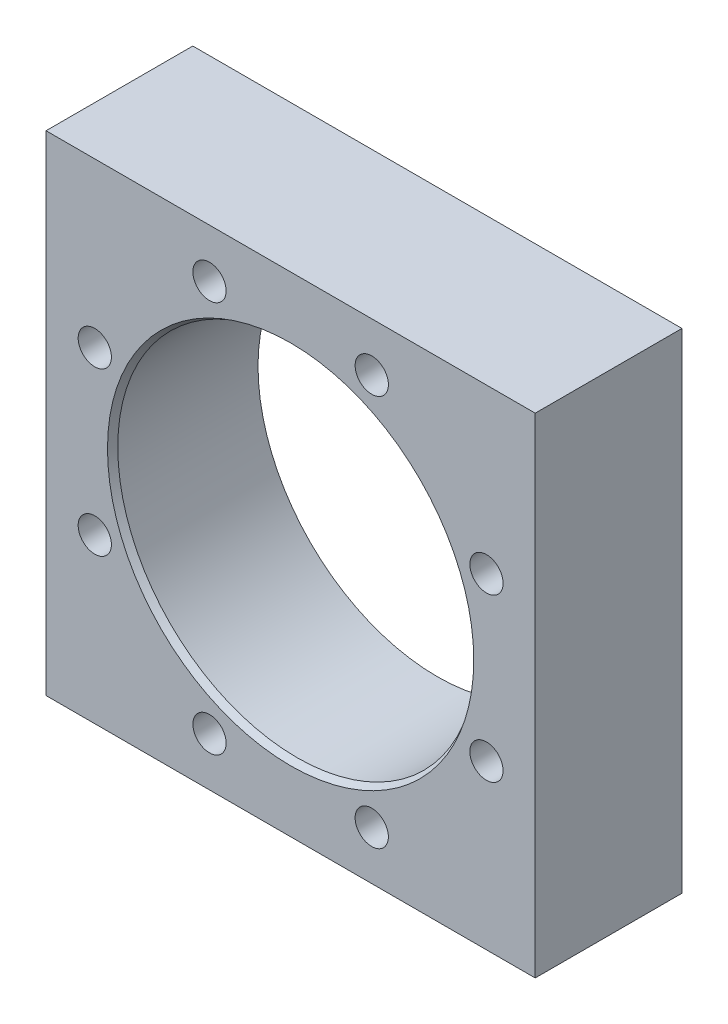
from build123d import *

# Parameters (mm, degrees)
ESQUISSE1_W                  = 150
ESQUISSE1_H                  = 150
ESQUISSE1_R                  = 55
EXTRUSION1_DEPTH             = 45
R_P_TITION_CIRCULAIRE1_COUNT = 8
CHANFREIN1_SIZE              = 2
CHANFREIN1_SIZE2             = 1.154700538


with BuildPart() as part:
    # Esquisse1 → Extrusion1 (new body)
    with BuildSketch(Plane.XY):
        with Locations((75, 75)):
            Rectangle(ESQUISSE1_W, ESQUISSE1_H)
        with Locations(Location((75, 75, 0), (0, 0, 180))):
            Circle(ESQUISSE1_R, mode=Mode.SUBTRACT)
    extrude(amount=EXTRUSION1_DEPTH)

    # Esquisse2 → Trou taraud_ M12x1.751 (revolve, cut)
    with BuildSketch(Plane(origin=(99.874423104, 135.052169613, 45), x_dir=(0, -1, 0), z_dir=(1, 0, 0))):
        Polygon((0, 0), (0, 38.064389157), (5.1, 35), (5.1, 0), align=None)
    trou_taraud_m12x1_751 = revolve(axis=Axis((99.874423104, 135.052169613, 51.35), (0, 0, -1)), mode=Mode.SUBTRACT)

    # R_p_tition circulaire1: Trou taraud_ M12x1.751 ×8 about axis
    r_p_tition_circulaire1_axis = Axis((75, 75, 0), (0, 0, 1))
    for i in range(1, R_P_TITION_CIRCULAIRE1_COUNT):
        add(trou_taraud_m12x1_751.rotate(r_p_tition_circulaire1_axis, i * 360 / R_P_TITION_CIRCULAIRE1_COUNT), mode=Mode.SUBTRACT)

    # Chanfrein1
    chanfrein1_edges = [part.edges().sort_by_distance(p)[0] for p in [
        (130, 75, 45),
    ]]
    chanfrein1_side = [part.faces().sort_by_distance(p)[0] for p in [
        (130, 75, 22.5),
    ]]
    chamfer(chanfrein1_edges, length=CHANFREIN1_SIZE, length2=CHANFREIN1_SIZE2, reference=chanfrein1_side[0])


solid = part.part
